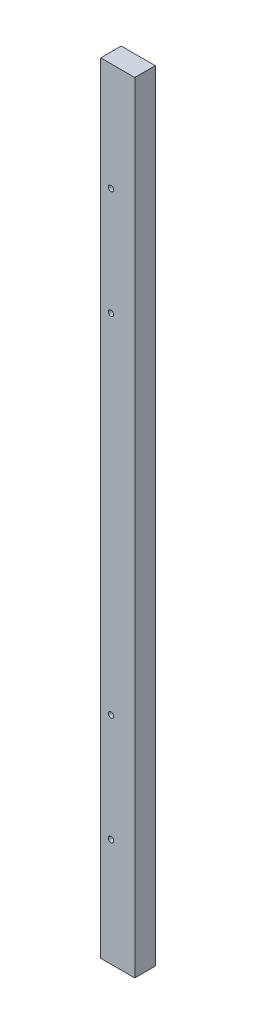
from build123d import *

# Parameters (mm, degrees)
SKETCH1_W           = 63
SKETCH1_H           = 1444
BOSS_EXTRUDE1_DEPTH = 38
CUT_EXTRUDE1_REACH  = 1447.873
SKETCH3_R           = 5


with BuildPart() as part:
    # Sketch1 → Boss-Extrude1 (new body)
    with BuildSketch(Plane.XY):
        with Locations((31.5, 722)):
            Rectangle(SKETCH1_W, SKETCH1_H)
    extrude(amount=BOSS_EXTRUDE1_DEPTH)

    # Sketch3 → Cut-Extrude1 (cut, up to next)
    with BuildSketch(Plane.XY.offset(38), mode=Mode.PRIVATE) as cut_extrude1_sk1:
        with Locations((19, 200)):
            Circle(SKETCH3_R)
    cut_extrude1_tool1 = extrude(cut_extrude1_sk1.sketch, amount=-CUT_EXTRUDE1_REACH, mode=Mode.PRIVATE) & part.part
    # Sketch3 → Cut-Extrude1 (cut, up to next)
    with BuildSketch(Plane.XY.offset(38), mode=Mode.PRIVATE) as cut_extrude1_sk2:
        with Locations((19, 400)):
            Circle(SKETCH3_R)
    cut_extrude1_tool2 = extrude(cut_extrude1_sk2.sketch, amount=-CUT_EXTRUDE1_REACH, mode=Mode.PRIVATE) & part.part
    # Sketch3 → Cut-Extrude1 (cut, up to next)
    with BuildSketch(Plane.XY.offset(38), mode=Mode.PRIVATE) as cut_extrude1_sk3:
        with Locations(Location((19, 1044, 0), (0, 0, 180))):
            Circle(SKETCH3_R)
    cut_extrude1_tool3 = extrude(cut_extrude1_sk3.sketch, amount=-CUT_EXTRUDE1_REACH, mode=Mode.PRIVATE) & part.part
    # Sketch3 → Cut-Extrude1 (cut, up to next)
    with BuildSketch(Plane.XY.offset(38), mode=Mode.PRIVATE) as cut_extrude1_sk4:
        with Locations(Location((19, 1244, 0), (0, 0, 180))):
            Circle(SKETCH3_R)
    cut_extrude1_tool4 = extrude(cut_extrude1_sk4.sketch, amount=-CUT_EXTRUDE1_REACH, mode=Mode.PRIVATE) & part.part
    add(cut_extrude1_tool1.solids().sort_by_distance((19, 200, 38))[0], mode=Mode.SUBTRACT)
    add(cut_extrude1_tool2.solids().sort_by_distance((19, 400, 38))[0], mode=Mode.SUBTRACT)
    add(cut_extrude1_tool3.solids().sort_by_distance((19, 1044, 38))[0], mode=Mode.SUBTRACT)
    add(cut_extrude1_tool4.solids().sort_by_distance((19, 1244, 38))[0], mode=Mode.SUBTRACT)


solid = part.part
